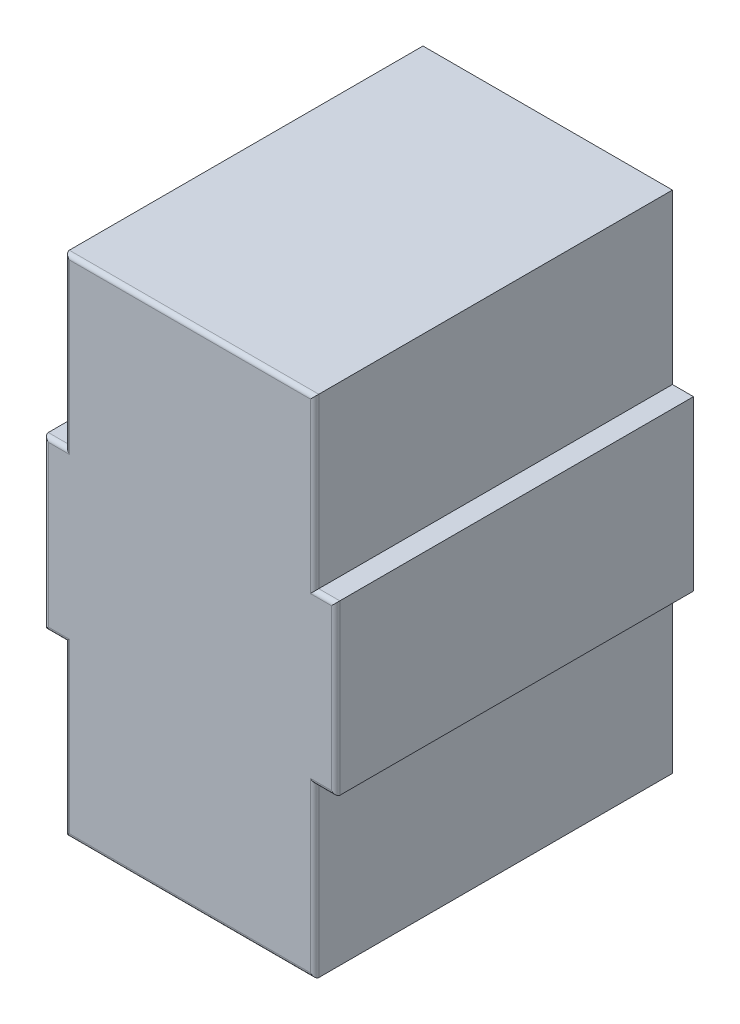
from build123d import *

# Parameters (mm, degrees)
EXTRUSION1_DEPTH = 17
CONG_1_R         = 0.2


with BuildPart() as part:
    # Esquisse1 → Extrusion1 (new body)
    with BuildSketch(Plane.XY):
        Polygon((12.85, 0), (12.85, 8), (13.85, 8), (13.85, 16), (12.85, 16), (12.85, 24), (1, 24), (1, 16), (0, 16), (0, 8), (1, 8), (1, 0), align=None)
    extrude(amount=EXTRUSION1_DEPTH)

    # Cong_1
    cong_1_edges = [part.edges().sort_by_distance(p)[0] for p in [
        (13.35, 8, 17),
        (13.85, 12, 17),
        (13.35, 16, 17),
        (12.85, 20, 17),
        (6.925, 24, 17),
        (1, 20, 17),
        (0.5, 16, 17),
        (0, 12, 17),
        (0.5, 8, 17),
        (1, 4, 17),
        (6.925, 0, 17),
        (12.85, 4, 17),
    ]]
    fillet(cong_1_edges, radius=CONG_1_R)


solid = part.part
